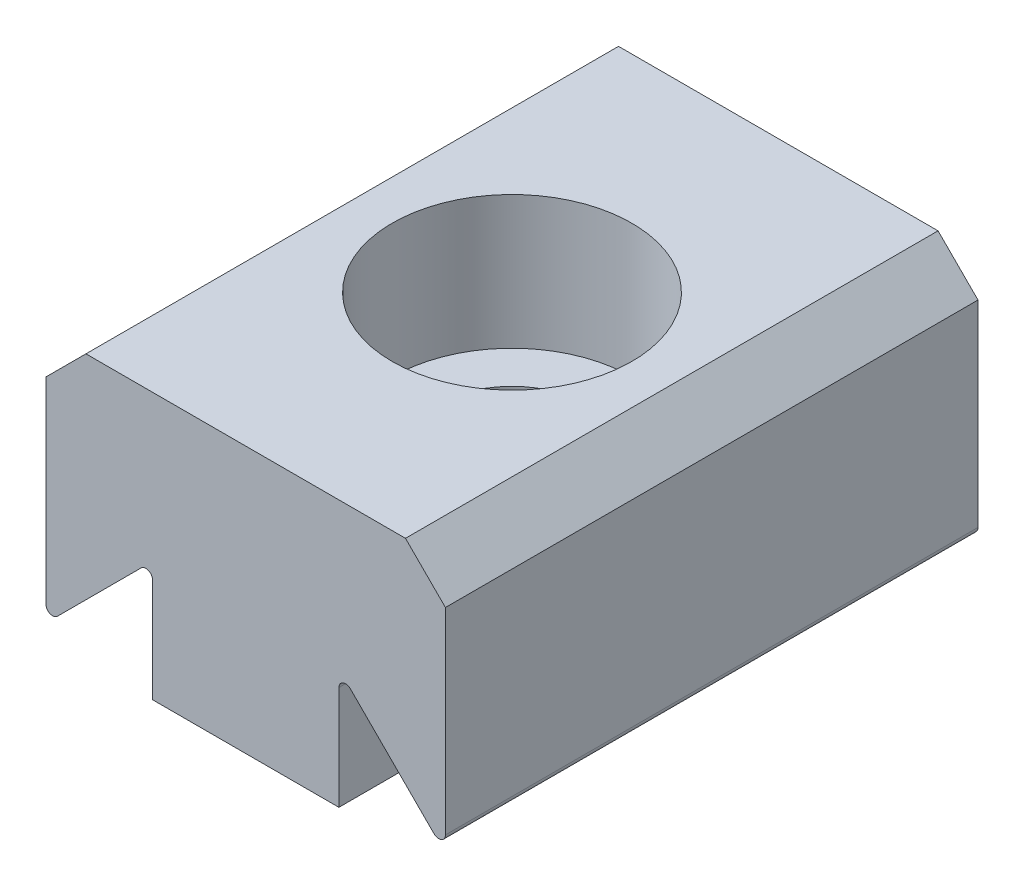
ISO-10303-21;
HEADER;
FILE_DESCRIPTION(('STEP AP214'),'2;1');
FILE_NAME('part.step','',(''),(''),'','','');
FILE_SCHEMA(('AUTOMOTIVE_DESIGN { 1 0 10303 214 1 1 1 1 }'));
ENDSEC;
DATA;
#1=APPLICATION_CONTEXT('core data for automotive mechanical design processes');
#2=APPLICATION_PROTOCOL_DEFINITION('international standard','automotive_design',2000,#1);
#3=PRODUCT_CONTEXT('',#1,'mechanical');
#4=PRODUCT('Part','Part','',(#3));
#5=PRODUCT_RELATED_PRODUCT_CATEGORY('part','',(#4));
#6=PRODUCT_DEFINITION_FORMATION('','',#4);
#7=PRODUCT_DEFINITION_CONTEXT('part definition',#1,'design');
#8=PRODUCT_DEFINITION('design','',#6,#7);
#9=PRODUCT_DEFINITION_SHAPE('','',#8);
#10=(LENGTH_UNIT() NAMED_UNIT(*) SI_UNIT(.MILLI.,.METRE.));
#11=(NAMED_UNIT(*) PLANE_ANGLE_UNIT() SI_UNIT($,.RADIAN.));
#12=(NAMED_UNIT(*) SI_UNIT($,.STERADIAN.) SOLID_ANGLE_UNIT());
#13=UNCERTAINTY_MEASURE_WITH_UNIT(LENGTH_MEASURE(1.E-05),#10,'distance_accuracy_value','');
#14=(GEOMETRIC_REPRESENTATION_CONTEXT(3) GLOBAL_UNCERTAINTY_ASSIGNED_CONTEXT((#13)) GLOBAL_UNIT_ASSIGNED_CONTEXT((#10,
#11,#12)) REPRESENTATION_CONTEXT('',''));
#15=CARTESIAN_POINT('',(0.,0.,0.));
#16=DIRECTION('',(0.,0.,1.));
#17=DIRECTION('',(1.,0.,0.));
#18=AXIS2_PLACEMENT_3D('',#15,#16,#17);
#19=CARTESIAN_POINT('',(-11.,16.5,10.));
#20=DIRECTION('',(0.,1.,0.));
#21=DIRECTION('',(0.,0.,1.));
#22=AXIS2_PLACEMENT_3D('',#19,#20,#21);
#23=PLANE('',#22);
#24=CARTESIAN_POINT('',(-3.5,16.5,0.));
#25=DIRECTION('',(0.,1.,0.));
#26=DIRECTION('',(0.,0.,1.));
#27=AXIS2_PLACEMENT_3D('',#24,#25,#26);
#28=CIRCLE('',#27,2.75);
#29=CARTESIAN_POINT('',(-3.5,16.5,2.75));
#30=VERTEX_POINT('',#29);
#31=EDGE_CURVE('E314',#30,#30,#28,.T.);
#32=ORIENTED_EDGE('',*,*,#31,.T.);
#33=EDGE_LOOP('',(#32));
#34=FACE_BOUND('',#33,.T.);
#35=DIRECTION('',(0.,0.,1.));
#36=VECTOR('',#35,1.);
#37=CARTESIAN_POINT('',(-7.00000000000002,16.5,10.));
#38=LINE('',#37,#36);
#39=CARTESIAN_POINT('',(-6.99999999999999,16.5,-10.));
#40=VERTEX_POINT('',#39);
#41=CARTESIAN_POINT('',(-7.00000000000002,16.5,10.));
#42=VERTEX_POINT('',#41);
#43=EDGE_CURVE('E171',#40,#42,#38,.T.);
#44=ORIENTED_EDGE('',*,*,#43,.F.);
#45=DIRECTION('',(1.,0.,0.));
#46=VECTOR('',#45,1.);
#47=CARTESIAN_POINT('',(-11.,16.5,-10.));
#48=LINE('',#47,#46);
#49=CARTESIAN_POINT('',(0.,16.5,-10.));
#50=VERTEX_POINT('',#49);
#51=EDGE_CURVE('E219',#40,#50,#48,.T.);
#52=ORIENTED_EDGE('',*,*,#51,.T.);
#53=DIRECTION('',(0.,0.,1.));
#54=VECTOR('',#53,1.);
#55=CARTESIAN_POINT('',(0.,16.5,10.));
#56=LINE('',#55,#54);
#57=CARTESIAN_POINT('',(0.,16.5,10.));
#58=VERTEX_POINT('',#57);
#59=EDGE_CURVE('E204',#50,#58,#56,.T.);
#60=ORIENTED_EDGE('',*,*,#59,.T.);
#61=DIRECTION('',(1.,0.,0.));
#62=VECTOR('',#61,1.);
#63=CARTESIAN_POINT('',(-11.,16.5,10.));
#64=LINE('',#63,#62);
#65=EDGE_CURVE('E227',#42,#58,#64,.T.);
#66=ORIENTED_EDGE('',*,*,#65,.F.);
#67=EDGE_LOOP('',(#44,#52,#60,#66));
#68=FACE_BOUND('',#67,.T.);
#69=ADVANCED_FACE('F28',(#34,#68),#23,.F.);
#70=CARTESIAN_POINT('',(4.,16.5,10.));
#71=DIRECTION('',(0.,0.,1.));
#72=DIRECTION('',(1.,0.,0.));
#73=AXIS2_PLACEMENT_3D('',#70,#71,#72);
#74=PLANE('',#73);
#75=DIRECTION('',(0.,1.,0.));
#76=VECTOR('',#75,1.);
#77=CARTESIAN_POINT('',(4.00000000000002,26.5,10.));
#78=LINE('',#77,#76);
#79=CARTESIAN_POINT('',(4.00000000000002,17.6035533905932,10.));
#80=VERTEX_POINT('',#79);
#81=CARTESIAN_POINT('',(4.,25.,10.));
#82=VERTEX_POINT('',#81);
#83=EDGE_CURVE('E221',#80,#82,#78,.T.);
#84=ORIENTED_EDGE('',*,*,#83,.T.);
#85=DIRECTION('',(0.707106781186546,-0.707106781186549,0.));
#86=VECTOR('',#85,1.);
#87=CARTESIAN_POINT('',(8.25000000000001,20.75,10.));
#88=LINE('',#87,#86);
#89=CARTESIAN_POINT('',(2.50000000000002,26.5,10.));
#90=VERTEX_POINT('',#89);
#91=EDGE_CURVE('E36',#82,#90,#88,.F.);
#92=ORIENTED_EDGE('',*,*,#91,.T.);
#93=DIRECTION('',(-1.,0.,0.));
#94=VECTOR('',#93,1.);
#95=CARTESIAN_POINT('',(-11.,26.5,10.));
#96=LINE('',#95,#94);
#97=CARTESIAN_POINT('',(-9.49999999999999,26.5,10.));
#98=VERTEX_POINT('',#97);
#99=EDGE_CURVE('E223',#90,#98,#96,.T.);
#100=ORIENTED_EDGE('',*,*,#99,.T.);
#101=DIRECTION('',(0.70710678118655,0.707106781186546,0.));
#102=VECTOR('',#101,1.);
#103=CARTESIAN_POINT('',(-7.74999999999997,28.25,10.));
#104=LINE('',#103,#102);
#105=CARTESIAN_POINT('',(-11.,25.,9.99999999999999));
#106=VERTEX_POINT('',#105);
#107=EDGE_CURVE('E43',#98,#106,#104,.F.);
#108=ORIENTED_EDGE('',*,*,#107,.T.);
#109=DIRECTION('',(0.,-1.,0.));
#110=VECTOR('',#109,1.);
#111=CARTESIAN_POINT('',(-11.,26.5,10.));
#112=LINE('',#111,#110);
#113=CARTESIAN_POINT('',(-11.,17.6035533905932,10.));
#114=VERTEX_POINT('',#113);
#115=EDGE_CURVE('E225',#106,#114,#112,.T.);
#116=ORIENTED_EDGE('',*,*,#115,.T.);
#117=CARTESIAN_POINT('',(-10.75,17.6035533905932,10.));
#118=DIRECTION('',(0.,0.,1.));
#119=DIRECTION('',(1.,0.,0.));
#120=AXIS2_PLACEMENT_3D('',#117,#118,#119);
#121=CIRCLE('',#120,0.250000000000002);
#122=CARTESIAN_POINT('',(-10.5732233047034,17.4267766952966,10.));
#123=VERTEX_POINT('',#122);
#124=EDGE_CURVE('E156',#114,#123,#121,.T.);
#125=ORIENTED_EDGE('',*,*,#124,.T.);
#126=DIRECTION('',(0.707106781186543,0.707106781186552,0.));
#127=VECTOR('',#126,1.);
#128=CARTESIAN_POINT('',(-10.5732233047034,17.4267766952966,10.));
#129=LINE('',#128,#127);
#130=CARTESIAN_POINT('',(-7.42677669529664,20.5732233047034,10.));
#131=VERTEX_POINT('',#130);
#132=EDGE_CURVE('E136',#123,#131,#129,.T.);
#133=ORIENTED_EDGE('',*,*,#132,.T.);
#134=CARTESIAN_POINT('',(-7.24999999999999,20.3964466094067,10.));
#135=DIRECTION('',(0.,0.,-1.));
#136=DIRECTION('',(-1.,0.,0.));
#137=AXIS2_PLACEMENT_3D('',#134,#135,#136);
#138=CIRCLE('',#137,0.25);
#139=CARTESIAN_POINT('',(-6.99999999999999,20.3964466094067,10.));
#140=VERTEX_POINT('',#139);
#141=EDGE_CURVE('E147',#131,#140,#138,.T.);
#142=ORIENTED_EDGE('',*,*,#141,.T.);
#143=DIRECTION('',(0.,-1.,0.));
#144=VECTOR('',#143,1.);
#145=CARTESIAN_POINT('',(-6.99999999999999,20.3964466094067,10.));
#146=LINE('',#145,#144);
#147=EDGE_CURVE('E158',#140,#42,#146,.T.);
#148=ORIENTED_EDGE('',*,*,#147,.T.);
#149=ORIENTED_EDGE('',*,*,#65,.T.);
#150=DIRECTION('',(0.,-1.,0.));
#151=VECTOR('',#150,1.);
#152=CARTESIAN_POINT('',(0.,20.3964466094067,10.));
#153=LINE('',#152,#151);
#154=CARTESIAN_POINT('',(0.,20.3964466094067,10.));
#155=VERTEX_POINT('',#154);
#156=EDGE_CURVE('E180',#155,#58,#153,.T.);
#157=ORIENTED_EDGE('',*,*,#156,.F.);
#158=CARTESIAN_POINT('',(0.250000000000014,20.3964466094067,10.));
#159=DIRECTION('',(0.,0.,1.));
#160=DIRECTION('',(1.,0.,0.));
#161=AXIS2_PLACEMENT_3D('',#158,#159,#160);
#162=CIRCLE('',#161,0.25);
#163=CARTESIAN_POINT('',(0.426776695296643,20.5732233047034,10.));
#164=VERTEX_POINT('',#163);
#165=EDGE_CURVE('E177',#164,#155,#162,.T.);
#166=ORIENTED_EDGE('',*,*,#165,.F.);
#167=DIRECTION('',(-0.707106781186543,0.707106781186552,0.));
#168=VECTOR('',#167,1.);
#169=CARTESIAN_POINT('',(3.57322330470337,17.4267766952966,10.));
#170=LINE('',#169,#168);
#171=CARTESIAN_POINT('',(3.57322330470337,17.4267766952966,10.));
#172=VERTEX_POINT('',#171);
#173=EDGE_CURVE('E186',#172,#164,#170,.T.);
#174=ORIENTED_EDGE('',*,*,#173,.F.);
#175=CARTESIAN_POINT('',(3.75000000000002,17.6035533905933,10.));
#176=DIRECTION('',(0.,0.,-1.));
#177=DIRECTION('',(-1.,0.,0.));
#178=AXIS2_PLACEMENT_3D('',#175,#176,#177);
#179=CIRCLE('',#178,0.250000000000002);
#180=EDGE_CURVE('E183',#80,#172,#179,.T.);
#181=ORIENTED_EDGE('',*,*,#180,.F.);
#182=EDGE_LOOP('',(#84,#92,#100,#108,#116,#125,#133,#142,#148,#149,#157,#166,#174,#181));
#183=FACE_BOUND('',#182,.T.);
#184=ADVANCED_FACE('F154',(#183),#74,.T.);
#185=CARTESIAN_POINT('',(4.,16.5,-10.));
#186=DIRECTION('',(0.,0.,1.));
#187=DIRECTION('',(1.,0.,0.));
#188=AXIS2_PLACEMENT_3D('',#185,#186,#187);
#189=PLANE('',#188);
#190=DIRECTION('',(-1.,0.,0.));
#191=VECTOR('',#190,1.);
#192=CARTESIAN_POINT('',(-11.,26.5,-10.));
#193=LINE('',#192,#191);
#194=CARTESIAN_POINT('',(2.5,26.5,-10.));
#195=VERTEX_POINT('',#194);
#196=CARTESIAN_POINT('',(-9.49999999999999,26.5,-10.));
#197=VERTEX_POINT('',#196);
#198=EDGE_CURVE('E214',#195,#197,#193,.T.);
#199=ORIENTED_EDGE('',*,*,#198,.F.);
#200=DIRECTION('',(-0.707106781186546,0.707106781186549,0.));
#201=VECTOR('',#200,1.);
#202=CARTESIAN_POINT('',(2.5,26.5,-10.));
#203=LINE('',#202,#201);
#204=CARTESIAN_POINT('',(3.99999999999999,25.,-10.));
#205=VERTEX_POINT('',#204);
#206=EDGE_CURVE('E236',#195,#205,#203,.F.);
#207=ORIENTED_EDGE('',*,*,#206,.T.);
#208=DIRECTION('',(0.,1.,0.));
#209=VECTOR('',#208,1.);
#210=CARTESIAN_POINT('',(4.,26.5,-10.));
#211=LINE('',#210,#209);
#212=CARTESIAN_POINT('',(4.,17.6035533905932,-10.));
#213=VERTEX_POINT('',#212);
#214=EDGE_CURVE('E212',#213,#205,#211,.T.);
#215=ORIENTED_EDGE('',*,*,#214,.F.);
#216=CARTESIAN_POINT('',(3.75,17.6035533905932,-10.));
#217=DIRECTION('',(0.,0.,-1.));
#218=DIRECTION('',(-1.,0.,0.));
#219=AXIS2_PLACEMENT_3D('',#216,#217,#218);
#220=CIRCLE('',#219,0.250000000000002);
#221=CARTESIAN_POINT('',(3.57322330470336,17.4267766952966,-10.));
#222=VERTEX_POINT('',#221);
#223=EDGE_CURVE('E195',#213,#222,#220,.T.);
#224=ORIENTED_EDGE('',*,*,#223,.T.);
#225=DIRECTION('',(-0.707106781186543,0.707106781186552,0.));
#226=VECTOR('',#225,1.);
#227=CARTESIAN_POINT('',(3.57322330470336,17.4267766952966,-10.));
#228=LINE('',#227,#226);
#229=CARTESIAN_POINT('',(0.42677669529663,20.5732233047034,-10.));
#230=VERTEX_POINT('',#229);
#231=EDGE_CURVE('E198',#222,#230,#228,.T.);
#232=ORIENTED_EDGE('',*,*,#231,.T.);
#233=CARTESIAN_POINT('',(0.25,20.3964466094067,-10.));
#234=DIRECTION('',(0.,0.,1.));
#235=DIRECTION('',(1.,0.,0.));
#236=AXIS2_PLACEMENT_3D('',#233,#234,#235);
#237=CIRCLE('',#236,0.25);
#238=CARTESIAN_POINT('',(0.,20.3964466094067,-10.));
#239=VERTEX_POINT('',#238);
#240=EDGE_CURVE('E189',#230,#239,#237,.T.);
#241=ORIENTED_EDGE('',*,*,#240,.T.);
#242=DIRECTION('',(0.,-1.,0.));
#243=VECTOR('',#242,1.);
#244=CARTESIAN_POINT('',(0.,20.3964466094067,-10.));
#245=LINE('',#244,#243);
#246=EDGE_CURVE('E192',#239,#50,#245,.T.);
#247=ORIENTED_EDGE('',*,*,#246,.T.);
#248=ORIENTED_EDGE('',*,*,#51,.F.);
#249=DIRECTION('',(0.,-1.,0.));
#250=VECTOR('',#249,1.);
#251=CARTESIAN_POINT('',(-6.99999999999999,20.3964466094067,-10.));
#252=LINE('',#251,#250);
#253=CARTESIAN_POINT('',(-6.99999999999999,20.3964466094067,-10.));
#254=VERTEX_POINT('',#253);
#255=EDGE_CURVE('E143',#254,#40,#252,.T.);
#256=ORIENTED_EDGE('',*,*,#255,.F.);
#257=CARTESIAN_POINT('',(-7.24999999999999,20.3964466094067,-10.));
#258=DIRECTION('',(0.,0.,-1.));
#259=DIRECTION('',(-1.,0.,0.));
#260=AXIS2_PLACEMENT_3D('',#257,#258,#259);
#261=CIRCLE('',#260,0.25);
#262=CARTESIAN_POINT('',(-7.42677669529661,20.5732233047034,-10.));
#263=VERTEX_POINT('',#262);
#264=EDGE_CURVE('E163',#263,#254,#261,.T.);
#265=ORIENTED_EDGE('',*,*,#264,.F.);
#266=DIRECTION('',(0.707106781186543,0.707106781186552,0.));
#267=VECTOR('',#266,1.);
#268=CARTESIAN_POINT('',(-10.5732233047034,17.4267766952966,-10.));
#269=LINE('',#268,#267);
#270=CARTESIAN_POINT('',(-10.5732233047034,17.4267766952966,-10.));
#271=VERTEX_POINT('',#270);
#272=EDGE_CURVE('E139',#271,#263,#269,.T.);
#273=ORIENTED_EDGE('',*,*,#272,.F.);
#274=CARTESIAN_POINT('',(-10.75,17.6035533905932,-10.));
#275=DIRECTION('',(0.,0.,1.));
#276=DIRECTION('',(1.,0.,0.));
#277=AXIS2_PLACEMENT_3D('',#274,#275,#276);
#278=CIRCLE('',#277,0.250000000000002);
#279=CARTESIAN_POINT('',(-11.,17.6035533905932,-10.));
#280=VERTEX_POINT('',#279);
#281=EDGE_CURVE('E166',#280,#271,#278,.T.);
#282=ORIENTED_EDGE('',*,*,#281,.F.);
#283=DIRECTION('',(0.,-1.,0.));
#284=VECTOR('',#283,1.);
#285=CARTESIAN_POINT('',(-11.,26.5,-10.));
#286=LINE('',#285,#284);
#287=CARTESIAN_POINT('',(-11.,25.,-10.));
#288=VERTEX_POINT('',#287);
#289=EDGE_CURVE('E217',#288,#280,#286,.T.);
#290=ORIENTED_EDGE('',*,*,#289,.F.);
#291=DIRECTION('',(-0.70710678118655,-0.707106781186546,0.));
#292=VECTOR('',#291,1.);
#293=CARTESIAN_POINT('',(-11.,25.,-10.));
#294=LINE('',#293,#292);
#295=EDGE_CURVE('E234',#288,#197,#294,.F.);
#296=ORIENTED_EDGE('',*,*,#295,.T.);
#297=EDGE_LOOP('',(#199,#207,#215,#224,#232,#241,#247,#248,#256,#265,#273,#282,#290,#296));
#298=FACE_BOUND('',#297,.T.);
#299=ADVANCED_FACE('F251',(#298),#189,.F.);
#300=CARTESIAN_POINT('',(4.00000000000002,26.5,10.));
#301=DIRECTION('',(-1.,0.,0.));
#302=DIRECTION('',(0.,0.,1.));
#303=AXIS2_PLACEMENT_3D('',#300,#301,#302);
#304=PLANE('',#303);
#305=ORIENTED_EDGE('',*,*,#214,.T.);
#306=DIRECTION('',(0.,0.,1.));
#307=VECTOR('',#306,1.);
#308=CARTESIAN_POINT('',(4.,25.,10.));
#309=LINE('',#308,#307);
#310=EDGE_CURVE('E51',#205,#82,#309,.T.);
#311=ORIENTED_EDGE('',*,*,#310,.T.);
#312=ORIENTED_EDGE('',*,*,#83,.F.);
#313=DIRECTION('',(0.,0.,1.));
#314=VECTOR('',#313,1.);
#315=CARTESIAN_POINT('',(4.,17.6035533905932,-10.));
#316=LINE('',#315,#314);
#317=EDGE_CURVE('E207',#213,#80,#316,.T.);
#318=ORIENTED_EDGE('',*,*,#317,.F.);
#319=EDGE_LOOP('',(#305,#311,#312,#318));
#320=FACE_BOUND('',#319,.T.);
#321=ADVANCED_FACE('F30',(#320),#304,.F.);
#322=CARTESIAN_POINT('',(-11.,26.5,10.));
#323=DIRECTION('',(0.,-1.,0.));
#324=DIRECTION('',(0.,0.,-1.));
#325=AXIS2_PLACEMENT_3D('',#322,#323,#324);
#326=PLANE('',#325);
#327=CARTESIAN_POINT('',(-3.49999999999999,26.5,0.));
#328=DIRECTION('',(0.,1.,0.));
#329=DIRECTION('',(0.,0.,1.));
#330=AXIS2_PLACEMENT_3D('',#327,#328,#329);
#331=CIRCLE('',#330,4.5);
#332=CARTESIAN_POINT('',(-3.49999999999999,26.5,4.5));
#333=VERTEX_POINT('',#332);
#334=EDGE_CURVE('E152',#333,#333,#331,.T.);
#335=ORIENTED_EDGE('',*,*,#334,.F.);
#336=EDGE_LOOP('',(#335));
#337=FACE_BOUND('',#336,.T.);
#338=ORIENTED_EDGE('',*,*,#99,.F.);
#339=DIRECTION('',(0.,0.,-1.));
#340=VECTOR('',#339,1.);
#341=CARTESIAN_POINT('',(2.50000000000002,26.5,10.));
#342=LINE('',#341,#340);
#343=EDGE_CURVE('E231',#90,#195,#342,.T.);
#344=ORIENTED_EDGE('',*,*,#343,.T.);
#345=ORIENTED_EDGE('',*,*,#198,.T.);
#346=DIRECTION('',(0.,0.,1.));
#347=VECTOR('',#346,1.);
#348=CARTESIAN_POINT('',(-9.49999999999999,26.5,10.));
#349=LINE('',#348,#347);
#350=EDGE_CURVE('E229',#197,#98,#349,.T.);
#351=ORIENTED_EDGE('',*,*,#350,.T.);
#352=EDGE_LOOP('',(#338,#344,#345,#351));
#353=FACE_BOUND('',#352,.T.);
#354=ADVANCED_FACE('F245',(#337,#353),#326,.F.);
#355=CARTESIAN_POINT('',(-11.,26.5,10.));
#356=DIRECTION('',(1.,0.,0.));
#357=DIRECTION('',(0.,1.,0.));
#358=AXIS2_PLACEMENT_3D('',#355,#356,#357);
#359=PLANE('',#358);
#360=ORIENTED_EDGE('',*,*,#115,.F.);
#361=DIRECTION('',(0.,0.,-1.));
#362=VECTOR('',#361,1.);
#363=CARTESIAN_POINT('',(-11.,25.,9.99999999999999));
#364=LINE('',#363,#362);
#365=EDGE_CURVE('E11',#106,#288,#364,.T.);
#366=ORIENTED_EDGE('',*,*,#365,.T.);
#367=ORIENTED_EDGE('',*,*,#289,.T.);
#368=DIRECTION('',(0.,0.,1.));
#369=VECTOR('',#368,1.);
#370=CARTESIAN_POINT('',(-11.,17.6035533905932,-10.));
#371=LINE('',#370,#369);
#372=EDGE_CURVE('E172',#280,#114,#371,.T.);
#373=ORIENTED_EDGE('',*,*,#372,.T.);
#374=EDGE_LOOP('',(#360,#366,#367,#373));
#375=FACE_BOUND('',#374,.T.);
#376=ADVANCED_FACE('F296',(#375),#359,.F.);
#377=CARTESIAN_POINT('',(0.,20.3964466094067,-10.));
#378=DIRECTION('',(-1.,0.,0.));
#379=DIRECTION('',(0.,-1.,0.));
#380=AXIS2_PLACEMENT_3D('',#377,#378,#379);
#381=PLANE('',#380);
#382=ORIENTED_EDGE('',*,*,#246,.F.);
#383=DIRECTION('',(0.,0.,1.));
#384=VECTOR('',#383,1.);
#385=CARTESIAN_POINT('',(0.,20.3964466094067,-10.));
#386=LINE('',#385,#384);
#387=EDGE_CURVE('E201',#239,#155,#386,.T.);
#388=ORIENTED_EDGE('',*,*,#387,.T.);
#389=ORIENTED_EDGE('',*,*,#156,.T.);
#390=ORIENTED_EDGE('',*,*,#59,.F.);
#391=EDGE_LOOP('',(#382,#388,#389,#390));
#392=FACE_BOUND('',#391,.T.);
#393=ADVANCED_FACE('F268',(#392),#381,.F.);
#394=CARTESIAN_POINT('',(0.25,20.3964466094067,-10.));
#395=DIRECTION('',(0.,0.,1.));
#396=DIRECTION('',(1.,0.,0.));
#397=AXIS2_PLACEMENT_3D('',#394,#395,#396);
#398=CYLINDRICAL_SURFACE('',#397,0.25);
#399=ORIENTED_EDGE('',*,*,#165,.T.);
#400=ORIENTED_EDGE('',*,*,#387,.F.);
#401=ORIENTED_EDGE('',*,*,#240,.F.);
#402=DIRECTION('',(0.,0.,1.));
#403=VECTOR('',#402,1.);
#404=CARTESIAN_POINT('',(0.42677669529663,20.5732233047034,-10.));
#405=LINE('',#404,#403);
#406=EDGE_CURVE('E202',#230,#164,#405,.T.);
#407=ORIENTED_EDGE('',*,*,#406,.T.);
#408=EDGE_LOOP('',(#399,#400,#401,#407));
#409=FACE_BOUND('',#408,.T.);
#410=ADVANCED_FACE('F265',(#409),#398,.F.);
#411=CARTESIAN_POINT('',(3.57322330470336,17.4267766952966,-10.));
#412=DIRECTION('',(0.707106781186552,0.707106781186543,0.));
#413=DIRECTION('',(-0.707106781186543,0.707106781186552,0.));
#414=AXIS2_PLACEMENT_3D('',#411,#412,#413);
#415=PLANE('',#414);
#416=ORIENTED_EDGE('',*,*,#173,.T.);
#417=ORIENTED_EDGE('',*,*,#406,.F.);
#418=ORIENTED_EDGE('',*,*,#231,.F.);
#419=DIRECTION('',(0.,0.,1.));
#420=VECTOR('',#419,1.);
#421=CARTESIAN_POINT('',(3.57322330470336,17.4267766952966,-10.));
#422=LINE('',#421,#420);
#423=EDGE_CURVE('E205',#222,#172,#422,.T.);
#424=ORIENTED_EDGE('',*,*,#423,.T.);
#425=EDGE_LOOP('',(#416,#417,#418,#424));
#426=FACE_BOUND('',#425,.T.);
#427=ADVANCED_FACE('F259',(#426),#415,.F.);
#428=CARTESIAN_POINT('',(3.75,17.6035533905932,-10.));
#429=DIRECTION('',(0.,0.,1.));
#430=DIRECTION('',(1.,0.,0.));
#431=AXIS2_PLACEMENT_3D('',#428,#429,#430);
#432=CYLINDRICAL_SURFACE('',#431,0.250000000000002);
#433=ORIENTED_EDGE('',*,*,#180,.T.);
#434=ORIENTED_EDGE('',*,*,#423,.F.);
#435=ORIENTED_EDGE('',*,*,#223,.F.);
#436=ORIENTED_EDGE('',*,*,#317,.T.);
#437=EDGE_LOOP('',(#433,#434,#435,#436));
#438=FACE_BOUND('',#437,.T.);
#439=ADVANCED_FACE('F254',(#438),#432,.T.);
#440=CARTESIAN_POINT('',(-6.99999999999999,20.3964466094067,-10.));
#441=DIRECTION('',(-1.,0.,0.));
#442=DIRECTION('',(0.,-1.,0.));
#443=AXIS2_PLACEMENT_3D('',#440,#441,#442);
#444=PLANE('',#443);
#445=ORIENTED_EDGE('',*,*,#43,.T.);
#446=ORIENTED_EDGE('',*,*,#147,.F.);
#447=DIRECTION('',(0.,0.,1.));
#448=VECTOR('',#447,1.);
#449=CARTESIAN_POINT('',(-6.99999999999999,20.3964466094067,-10.));
#450=LINE('',#449,#448);
#451=EDGE_CURVE('E150',#254,#140,#450,.T.);
#452=ORIENTED_EDGE('',*,*,#451,.F.);
#453=ORIENTED_EDGE('',*,*,#255,.T.);
#454=EDGE_LOOP('',(#445,#446,#452,#453));
#455=FACE_BOUND('',#454,.T.);
#456=ADVANCED_FACE('F274',(#455),#444,.T.);
#457=CARTESIAN_POINT('',(-7.24999999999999,20.3964466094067,-10.));
#458=DIRECTION('',(0.,0.,1.));
#459=DIRECTION('',(1.,0.,0.));
#460=AXIS2_PLACEMENT_3D('',#457,#458,#459);
#461=CYLINDRICAL_SURFACE('',#460,0.25);
#462=ORIENTED_EDGE('',*,*,#141,.F.);
#463=DIRECTION('',(0.,0.,1.));
#464=VECTOR('',#463,1.);
#465=CARTESIAN_POINT('',(-7.42677669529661,20.5732233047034,-10.));
#466=LINE('',#465,#464);
#467=EDGE_CURVE('E132',#263,#131,#466,.T.);
#468=ORIENTED_EDGE('',*,*,#467,.F.);
#469=ORIENTED_EDGE('',*,*,#264,.T.);
#470=ORIENTED_EDGE('',*,*,#451,.T.);
#471=EDGE_LOOP('',(#462,#468,#469,#470));
#472=FACE_BOUND('',#471,.T.);
#473=ADVANCED_FACE('F148',(#472),#461,.F.);
#474=CARTESIAN_POINT('',(-10.75,17.6035533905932,-10.));
#475=DIRECTION('',(0.,0.,1.));
#476=DIRECTION('',(1.,0.,0.));
#477=AXIS2_PLACEMENT_3D('',#474,#475,#476);
#478=CYLINDRICAL_SURFACE('',#477,0.250000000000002);
#479=ORIENTED_EDGE('',*,*,#124,.F.);
#480=ORIENTED_EDGE('',*,*,#372,.F.);
#481=ORIENTED_EDGE('',*,*,#281,.T.);
#482=DIRECTION('',(0.,0.,1.));
#483=VECTOR('',#482,1.);
#484=CARTESIAN_POINT('',(-10.5732233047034,17.4267766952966,-10.));
#485=LINE('',#484,#483);
#486=EDGE_CURVE('E142',#271,#123,#485,.T.);
#487=ORIENTED_EDGE('',*,*,#486,.T.);
#488=EDGE_LOOP('',(#479,#480,#481,#487));
#489=FACE_BOUND('',#488,.T.);
#490=ADVANCED_FACE('F281',(#489),#478,.T.);
#491=CARTESIAN_POINT('',(-10.5732233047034,17.4267766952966,-10.));
#492=DIRECTION('',(0.707106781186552,-0.707106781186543,0.));
#493=DIRECTION('',(0.707106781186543,0.707106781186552,0.));
#494=AXIS2_PLACEMENT_3D('',#491,#492,#493);
#495=PLANE('',#494);
#496=ORIENTED_EDGE('',*,*,#132,.F.);
#497=ORIENTED_EDGE('',*,*,#486,.F.);
#498=ORIENTED_EDGE('',*,*,#272,.T.);
#499=ORIENTED_EDGE('',*,*,#467,.T.);
#500=EDGE_LOOP('',(#496,#497,#498,#499));
#501=FACE_BOUND('',#500,.T.);
#502=ADVANCED_FACE('F134',(#501),#495,.T.);
#503=CARTESIAN_POINT('',(2.50000000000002,26.5,10.));
#504=DIRECTION('',(-0.707106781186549,-0.707106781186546,0.));
#505=DIRECTION('',(0.707106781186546,-0.707106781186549,0.));
#506=AXIS2_PLACEMENT_3D('',#503,#504,#505);
#507=PLANE('',#506);
#508=ORIENTED_EDGE('',*,*,#91,.F.);
#509=ORIENTED_EDGE('',*,*,#310,.F.);
#510=ORIENTED_EDGE('',*,*,#206,.F.);
#511=ORIENTED_EDGE('',*,*,#343,.F.);
#512=EDGE_LOOP('',(#508,#509,#510,#511));
#513=FACE_BOUND('',#512,.T.);
#514=ADVANCED_FACE('F248',(#513),#507,.F.);
#515=CARTESIAN_POINT('',(-11.,25.,9.99999999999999));
#516=DIRECTION('',(0.707106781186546,-0.70710678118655,0.));
#517=DIRECTION('',(0.70710678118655,0.707106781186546,0.));
#518=AXIS2_PLACEMENT_3D('',#515,#516,#517);
#519=PLANE('',#518);
#520=ORIENTED_EDGE('',*,*,#107,.F.);
#521=ORIENTED_EDGE('',*,*,#350,.F.);
#522=ORIENTED_EDGE('',*,*,#295,.F.);
#523=ORIENTED_EDGE('',*,*,#365,.F.);
#524=EDGE_LOOP('',(#520,#521,#522,#523));
#525=FACE_BOUND('',#524,.T.);
#526=ADVANCED_FACE('F331',(#525),#519,.F.);
#527=CARTESIAN_POINT('',(-3.49999999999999,26.5,0.));
#528=DIRECTION('',(0.,1.,0.));
#529=DIRECTION('',(0.,0.,1.));
#530=AXIS2_PLACEMENT_3D('',#527,#528,#529);
#531=CYLINDRICAL_SURFACE('',#530,4.5);
#532=CARTESIAN_POINT('',(-3.5,21.5,0.));
#533=DIRECTION('',(0.,1.,0.));
#534=DIRECTION('',(0.,0.,1.));
#535=AXIS2_PLACEMENT_3D('',#532,#533,#534);
#536=CIRCLE('',#535,4.5);
#537=CARTESIAN_POINT('',(-3.5,21.5,4.5));
#538=VERTEX_POINT('',#537);
#539=EDGE_CURVE('E307',#538,#538,#536,.T.);
#540=ORIENTED_EDGE('',*,*,#539,.F.);
#541=EDGE_LOOP('',(#540));
#542=FACE_BOUND('',#541,.T.);
#543=ORIENTED_EDGE('',*,*,#334,.T.);
#544=EDGE_LOOP('',(#543));
#545=FACE_BOUND('',#544,.T.);
#546=ADVANCED_FACE('F326',(#542,#545),#531,.F.);
#547=CARTESIAN_POINT('',(-0.750000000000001,21.5,0.));
#548=DIRECTION('',(0.,-1.,0.));
#549=DIRECTION('',(0.,0.,-1.));
#550=AXIS2_PLACEMENT_3D('',#547,#548,#549);
#551=PLANE('',#550);
#552=CARTESIAN_POINT('',(-3.5,21.5,0.));
#553=DIRECTION('',(0.,1.,0.));
#554=DIRECTION('',(0.,0.,1.));
#555=AXIS2_PLACEMENT_3D('',#552,#553,#554);
#556=CIRCLE('',#555,2.75);
#557=CARTESIAN_POINT('',(-3.5,21.5,2.75));
#558=VERTEX_POINT('',#557);
#559=EDGE_CURVE('E309',#558,#558,#556,.T.);
#560=ORIENTED_EDGE('',*,*,#559,.F.);
#561=EDGE_LOOP('',(#560));
#562=FACE_BOUND('',#561,.T.);
#563=ORIENTED_EDGE('',*,*,#539,.T.);
#564=EDGE_LOOP('',(#563));
#565=FACE_BOUND('',#564,.T.);
#566=ADVANCED_FACE('F320',(#562,#565),#551,.F.);
#567=CARTESIAN_POINT('',(-3.49999999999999,26.5,0.));
#568=DIRECTION('',(0.,1.,0.));
#569=DIRECTION('',(0.,0.,1.));
#570=AXIS2_PLACEMENT_3D('',#567,#568,#569);
#571=CYLINDRICAL_SURFACE('',#570,2.75);
#572=ORIENTED_EDGE('',*,*,#31,.F.);
#573=EDGE_LOOP('',(#572));
#574=FACE_BOUND('',#573,.T.);
#575=ORIENTED_EDGE('',*,*,#559,.T.);
#576=EDGE_LOOP('',(#575));
#577=FACE_BOUND('',#576,.T.);
#578=ADVANCED_FACE('F317',(#574,#577),#571,.F.);
#579=CLOSED_SHELL('',(#69,#184,#299,#321,#354,#376,#393,#410,#427,#439,#456,#473,#490,#502,#514,
#526,#546,#566,#578));
#580=MANIFOLD_SOLID_BREP('B2',#579);
#581=ADVANCED_BREP_SHAPE_REPRESENTATION('',(#18,#580),#14);
#582=SHAPE_DEFINITION_REPRESENTATION(#9,#581);
ENDSEC;
END-ISO-10303-21;
